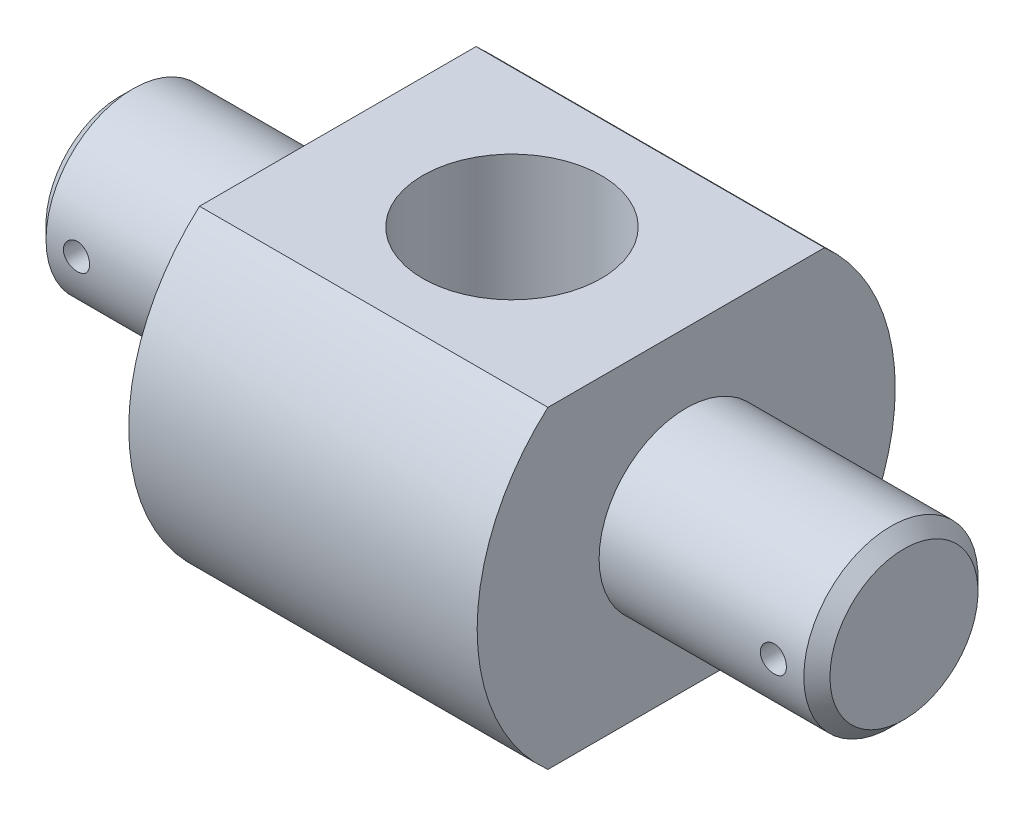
from build123d import *

# Parameters (mm, degrees)
CHANFREIN1_SIZE              = 1.5
ENL_V_MAT_EXTRU_1_DEPTH      = 97.187317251
ENL_V_MAT_EXTRU_1_DEPTH_BACK = 97.187317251
ESQUISSE2_W                  = 59.779338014
ESQUISSE2_H                  = 20.561685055
ESQUISSE2_H_2                = 16.148445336
ESQUISSE3_R                  = 10.25
ENL_V_MAT_EXTRU_2_DEPTH      = 100.859901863
ENL_V_MAT_EXTRU_3_DEPTH      = 95.868329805
ENL_V_MAT_EXTRU_3_DEPTH_BACK = 95.868329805
ESQUISSE4_R                  = 1.5


with BuildPart() as part:
    # Esquisse1 → R_volution1 (revolve)
    with BuildSketch(Plane.XY, mode=Mode.PRIVATE) as r_volution1_sk:
        Polygon((0, 0), (0, 10), (25, 10), (25, 24), (65, 24), (65, 10), (90, 10), (90, 0), align=None)
    revolve(r_volution1_sk.sketch.rotate(Axis((0, 0, 0), (1, 0, 0)), 90), axis=Axis((0, 0, 0), (1, 0, 0)))

    # Chanfrein1
    chanfrein1_edges = [part.edges().sort_by_distance(p)[0] for p in [
        (90, 0, -10),
        (0, 0, -10),
    ]]
    chamfer(chanfrein1_edges, length=CHANFREIN1_SIZE)

    # Esquisse2 → Enl_v. mat.-Extru.1 (cut, two sides: drawn at the far end of the back side and taken through both)
    with BuildSketch(Plane.XY.offset(-ENL_V_MAT_EXTRU_1_DEPTH_BACK)):
        with Locations((44.548645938, 28.280842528)):
            Rectangle(ESQUISSE2_W, ESQUISSE2_H)
        with Locations((44.548645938, -26.074222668)):
            Rectangle(ESQUISSE2_W, ESQUISSE2_H_2)
    extrude(amount=ENL_V_MAT_EXTRU_1_DEPTH + ENL_V_MAT_EXTRU_1_DEPTH_BACK, mode=Mode.SUBTRACT)

    # Esquisse3 → Enl_v. mat.-Extru.2 (cut, through all)
    with BuildSketch(Plane(origin=(0, 18, 0), x_dir=(-1, 0, 0), z_dir=(0, 1, 0))):
        with Locations((-45, 0)):
            Circle(ESQUISSE3_R)
    extrude(amount=-ENL_V_MAT_EXTRU_2_DEPTH, mode=Mode.SUBTRACT)

    # Esquisse4 → Enl_v. mat.-Extru.3 (cut, two sides: drawn at the far end of the back side and taken through both)
    with BuildSketch(Plane.XY.offset(-ENL_V_MAT_EXTRU_3_DEPTH_BACK)):
        with Locations((5, 0)):
            Circle(ESQUISSE4_R)
        with Locations((85, 0)):
            Circle(ESQUISSE4_R)
    extrude(amount=ENL_V_MAT_EXTRU_3_DEPTH + ENL_V_MAT_EXTRU_3_DEPTH_BACK, mode=Mode.SUBTRACT)


solid = part.part
